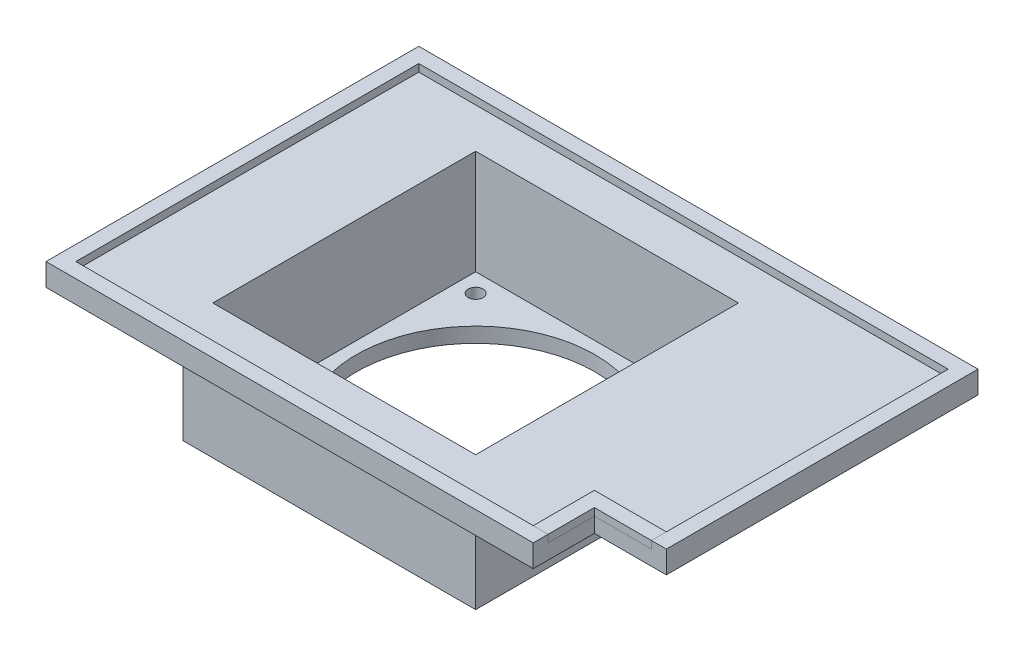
from build123d import *

# Parameters (mm, degrees)
SKETCH1_W           = 150
SKETCH1_H           = 100
SKETCH1_W_2         = 142
SKETCH1_H_2         = 92
BOSS_EXTRUDE1_DEPTH = 6
SKETCH1_3_W         = 142
SKETCH1_3_H         = 92
BOSS_EXTRUDE2_DEPTH = 4
SKETCH2_W           = 19.3
SKETCH2_H           = 16.4
CUT_EXTRUDE1_DEPTH  = 6
SKETCH3_W           = 78.5
SKETCH3_H           = 78.5
SKETCH3_W_2         = 70.5
SKETCH3_H_2         = 70.5
BOSS_EXTRUDE3_DEPTH = 24
SKETCH3_3_W         = 70.5
SKETCH3_3_H         = 70.5
CUT_EXTRUDE2_DEPTH  = 24
SKETCH4_W           = 78.5
SKETCH4_H           = 78.5
SKETCH4_R           = 32
BOSS_EXTRUDE4_DEPTH = 4
SKETCH5_W           = 4
SKETCH5_H           = 12.4
BOSS_EXTRUDE5_DEPTH = 2
SKETCH6_R           = 2
CUT_EXTRUDE3_DEPTH  = 4


with BuildPart() as part:
    # Sketch1 → Boss-Extrude1 (new body)
    with BuildSketch(Plane(origin=(0, 0, 0), x_dir=(1, 0, 0), z_dir=(0, 1, 0))):
        with Locations((75, 50)):
            Rectangle(SKETCH1_W, SKETCH1_H)
        with Locations((75, 50)):
            Rectangle(SKETCH1_W_2, SKETCH1_H_2, mode=Mode.SUBTRACT)
    extrude(amount=BOSS_EXTRUDE1_DEPTH)

    # Sketch1_3 → Boss-Extrude2 (add)
    with BuildSketch(Plane(origin=(0, 0, 0), x_dir=(1, 0, 0), z_dir=(0, 1, 0))):
        with Locations((75, 50)):
            Rectangle(SKETCH1_3_W, SKETCH1_3_H)
    extrude(amount=BOSS_EXTRUDE2_DEPTH)

    # Sketch2 → Cut-Extrude1 (cut)
    with BuildSketch(Plane(origin=(0, 6, 0), x_dir=(1, 0, 0), z_dir=(0, 1, 0))):
        with Locations((140.35, 8.2)):
            Rectangle(SKETCH2_W, SKETCH2_H)
    extrude(amount=-CUT_EXTRUDE1_DEPTH, mode=Mode.SUBTRACT)

    # Sketch3 → Boss-Extrude3 (add)
    with BuildSketch(Plane(origin=(0, 0, 0), x_dir=(-1, 0, 0), z_dir=(0, -1, 0))):
        with Locations((-65.25, 50)):
            Rectangle(SKETCH3_W, SKETCH3_H)
        with Locations((-65.25, 50)):
            Rectangle(SKETCH3_W_2, SKETCH3_H_2, mode=Mode.SUBTRACT)
    extrude(amount=BOSS_EXTRUDE3_DEPTH)

    # Sketch3_3 → Cut-Extrude2 (cut)
    with BuildSketch(Plane(origin=(0, 0, 0), x_dir=(-1, 0, 0), z_dir=(0, -1, 0))):
        with Locations((-65.25, 50)):
            Rectangle(SKETCH3_3_W, SKETCH3_3_H)
    extrude(amount=-CUT_EXTRUDE2_DEPTH, mode=Mode.SUBTRACT)

    # Sketch4 → Boss-Extrude4 (add)
    with BuildSketch(Plane(origin=(0, -24, 0), x_dir=(-1, 0, 0), z_dir=(0, -1, 0))):
        with Locations((-65.25, 50)):
            Rectangle(SKETCH4_W, SKETCH4_H)
        with Locations(Location((-65.25, 50, 0), (0, 0, 90))):
            Circle(SKETCH4_R, mode=Mode.SUBTRACT)
    extrude(amount=BOSS_EXTRUDE4_DEPTH)

    # Sketch6 → Cut-Extrude3 (cut)
    with BuildSketch(Plane.XZ.offset(28)):
        with Locations(Location((35, -19.75, 0), (0, 0, 270))):
            Circle(SKETCH6_R)
        with Locations(Location((95.5, -19.75, 0), (0, 0, 270))):
            Circle(SKETCH6_R)
        with Locations(Location((95.5, -80.25, 0), (0, 0, 270))):
            Circle(SKETCH6_R)
        with Locations(Location((35, -80.25, 0), (0, 0, 270))):
            Circle(SKETCH6_R)
    extrude(amount=-CUT_EXTRUDE3_DEPTH, mode=Mode.SUBTRACT)


with BuildPart() as body_2:
    # Sketch5 → Boss-Extrude5 (new body)
    with BuildSketch(Plane(origin=(0, 4, 0), x_dir=(1, 0, 0), z_dir=(0, 1, 0))):
        Polygon((130.7, 16.4), (146, 16.4), (146, 20.4), (126.7, 20.4), (126.7, 16.4), align=None)
        with Locations((128.7, 10.2)):
            Rectangle(SKETCH5_W, SKETCH5_H)
    extrude(amount=BOSS_EXTRUDE5_DEPTH)


solid = Compound([part.part, body_2.part])
